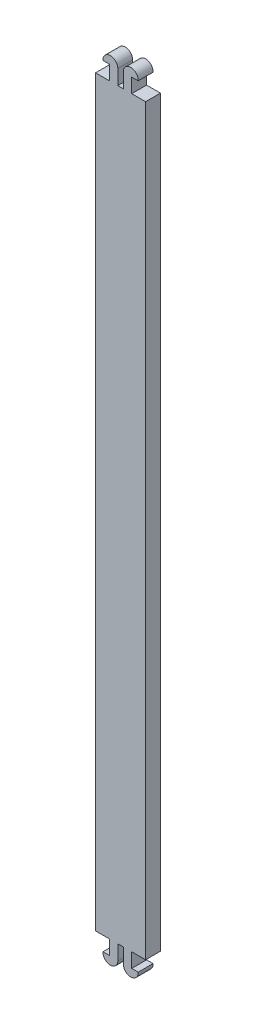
ISO-10303-21;
HEADER;
FILE_DESCRIPTION(('STEP AP214'),'2;1');
FILE_NAME('part.step','',(''),(''),'','','');
FILE_SCHEMA(('AUTOMOTIVE_DESIGN { 1 0 10303 214 1 1 1 1 }'));
ENDSEC;
DATA;
#1=APPLICATION_CONTEXT('core data for automotive mechanical design processes');
#2=APPLICATION_PROTOCOL_DEFINITION('international standard','automotive_design',2000,#1);
#3=PRODUCT_CONTEXT('',#1,'mechanical');
#4=PRODUCT('Part','Part','',(#3));
#5=PRODUCT_RELATED_PRODUCT_CATEGORY('part','',(#4));
#6=PRODUCT_DEFINITION_FORMATION('','',#4);
#7=PRODUCT_DEFINITION_CONTEXT('part definition',#1,'design');
#8=PRODUCT_DEFINITION('design','',#6,#7);
#9=PRODUCT_DEFINITION_SHAPE('','',#8);
#10=(LENGTH_UNIT() NAMED_UNIT(*) SI_UNIT(.MILLI.,.METRE.));
#11=(NAMED_UNIT(*) PLANE_ANGLE_UNIT() SI_UNIT($,.RADIAN.));
#12=(NAMED_UNIT(*) SI_UNIT($,.STERADIAN.) SOLID_ANGLE_UNIT());
#13=UNCERTAINTY_MEASURE_WITH_UNIT(LENGTH_MEASURE(1.E-05),#10,'distance_accuracy_value','');
#14=(GEOMETRIC_REPRESENTATION_CONTEXT(3) GLOBAL_UNCERTAINTY_ASSIGNED_CONTEXT((#13)) GLOBAL_UNIT_ASSIGNED_CONTEXT((#10,
#11,#12)) REPRESENTATION_CONTEXT('',''));
#15=CARTESIAN_POINT('',(0.,0.,0.));
#16=DIRECTION('',(0.,0.,1.));
#17=DIRECTION('',(1.,0.,0.));
#18=AXIS2_PLACEMENT_3D('',#15,#16,#17);
#19=CARTESIAN_POINT('',(2.058,-115.5,3.));
#20=DIRECTION('',(0.,0.,-1.));
#21=DIRECTION('',(-1.,0.,0.));
#22=AXIS2_PLACEMENT_3D('',#19,#20,#21);
#23=CYLINDRICAL_SURFACE('',#22,1.504);
#24=CARTESIAN_POINT('',(2.058,-115.5,0.));
#25=DIRECTION('',(0.,0.,1.));
#26=DIRECTION('',(1.,0.,0.));
#27=AXIS2_PLACEMENT_3D('',#24,#25,#26);
#28=CIRCLE('',#27,1.504);
#29=CARTESIAN_POINT('',(3.5586718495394,-115.4,0.));
#30=VERTEX_POINT('',#29);
#31=CARTESIAN_POINT('',(0.553999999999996,-115.5,0.));
#32=VERTEX_POINT('',#31);
#33=EDGE_CURVE('E239',#30,#32,#28,.F.);
#34=ORIENTED_EDGE('',*,*,#33,.F.);
#35=DIRECTION('',(0.,0.,-1.));
#36=VECTOR('',#35,1.);
#37=CARTESIAN_POINT('',(3.5586718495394,-115.4,3.));
#38=LINE('',#37,#36);
#39=CARTESIAN_POINT('',(3.5586718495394,-115.4,3.));
#40=VERTEX_POINT('',#39);
#41=EDGE_CURVE('E11',#40,#30,#38,.T.);
#42=ORIENTED_EDGE('',*,*,#41,.F.);
#43=CARTESIAN_POINT('',(2.058,-115.5,3.));
#44=DIRECTION('',(0.,0.,1.));
#45=DIRECTION('',(1.,0.,0.));
#46=AXIS2_PLACEMENT_3D('',#43,#44,#45);
#47=CIRCLE('',#46,1.504);
#48=CARTESIAN_POINT('',(0.553999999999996,-115.5,3.));
#49=VERTEX_POINT('',#48);
#50=EDGE_CURVE('E324',#40,#49,#47,.F.);
#51=ORIENTED_EDGE('',*,*,#50,.T.);
#52=DIRECTION('',(0.,0.,-1.));
#53=VECTOR('',#52,1.);
#54=CARTESIAN_POINT('',(0.553999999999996,-115.5,3.));
#55=LINE('',#54,#53);
#56=EDGE_CURVE('E145',#49,#32,#55,.T.);
#57=ORIENTED_EDGE('',*,*,#56,.T.);
#58=EDGE_LOOP('',(#34,#42,#51,#57));
#59=FACE_BOUND('',#58,.T.);
#60=ADVANCED_FACE('F46',(#59),#23,.T.);
#61=CARTESIAN_POINT('',(0.,-115.4,3.));
#62=DIRECTION('',(0.,1.,0.));
#63=DIRECTION('',(0.,0.,1.));
#64=AXIS2_PLACEMENT_3D('',#61,#62,#63);
#65=PLANE('',#64);
#66=DIRECTION('',(1.,0.,0.));
#67=VECTOR('',#66,1.);
#68=CARTESIAN_POINT('',(0.,-115.4,0.));
#69=LINE('',#68,#67);
#70=CARTESIAN_POINT('',(2.254,-115.4,0.));
#71=VERTEX_POINT('',#70);
#72=EDGE_CURVE('E243',#71,#30,#69,.T.);
#73=ORIENTED_EDGE('',*,*,#72,.F.);
#74=DIRECTION('',(0.,0.,-1.));
#75=VECTOR('',#74,1.);
#76=CARTESIAN_POINT('',(2.254,-115.4,3.));
#77=LINE('',#76,#75);
#78=CARTESIAN_POINT('',(2.254,-115.4,3.));
#79=VERTEX_POINT('',#78);
#80=EDGE_CURVE('E55',#79,#71,#77,.T.);
#81=ORIENTED_EDGE('',*,*,#80,.F.);
#82=DIRECTION('',(1.,0.,0.));
#83=VECTOR('',#82,1.);
#84=CARTESIAN_POINT('',(0.,-115.4,3.));
#85=LINE('',#84,#83);
#86=EDGE_CURVE('E414',#79,#40,#85,.T.);
#87=ORIENTED_EDGE('',*,*,#86,.T.);
#88=ORIENTED_EDGE('',*,*,#41,.T.);
#89=EDGE_LOOP('',(#73,#81,#87,#88));
#90=FACE_BOUND('',#89,.T.);
#91=ADVANCED_FACE('F402',(#90),#65,.T.);
#92=CARTESIAN_POINT('',(2.254,0.,3.));
#93=DIRECTION('',(1.,0.,0.));
#94=DIRECTION('',(0.,0.,-1.));
#95=AXIS2_PLACEMENT_3D('',#92,#93,#94);
#96=PLANE('',#95);
#97=DIRECTION('',(0.,-1.,0.));
#98=VECTOR('',#97,1.);
#99=CARTESIAN_POINT('',(2.254,0.,0.));
#100=LINE('',#99,#98);
#101=CARTESIAN_POINT('',(2.254,-112.5,0.));
#102=VERTEX_POINT('',#101);
#103=EDGE_CURVE('E247',#102,#71,#100,.T.);
#104=ORIENTED_EDGE('',*,*,#103,.F.);
#105=DIRECTION('',(0.,0.,-1.));
#106=VECTOR('',#105,1.);
#107=CARTESIAN_POINT('',(2.254,-112.5,3.));
#108=LINE('',#107,#106);
#109=CARTESIAN_POINT('',(2.254,-112.5,3.));
#110=VERTEX_POINT('',#109);
#111=EDGE_CURVE('E389',#110,#102,#108,.T.);
#112=ORIENTED_EDGE('',*,*,#111,.F.);
#113=DIRECTION('',(0.,-1.,0.));
#114=VECTOR('',#113,1.);
#115=CARTESIAN_POINT('',(2.254,0.,3.));
#116=LINE('',#115,#114);
#117=EDGE_CURVE('E398',#110,#79,#116,.T.);
#118=ORIENTED_EDGE('',*,*,#117,.T.);
#119=ORIENTED_EDGE('',*,*,#80,.T.);
#120=EDGE_LOOP('',(#104,#112,#118,#119));
#121=FACE_BOUND('',#120,.T.);
#122=ADVANCED_FACE('F396',(#121),#96,.T.);
#123=CARTESIAN_POINT('',(0.,-112.5,3.));
#124=DIRECTION('',(0.,-1.,0.));
#125=DIRECTION('',(0.,0.,-1.));
#126=AXIS2_PLACEMENT_3D('',#123,#124,#125);
#127=PLANE('',#126);
#128=DIRECTION('',(-1.,0.,0.));
#129=VECTOR('',#128,1.);
#130=CARTESIAN_POINT('',(0.,-112.5,0.));
#131=LINE('',#130,#129);
#132=CARTESIAN_POINT('',(5.05,-112.5,0.));
#133=VERTEX_POINT('',#132);
#134=EDGE_CURVE('E251',#133,#102,#131,.T.);
#135=ORIENTED_EDGE('',*,*,#134,.F.);
#136=DIRECTION('',(0.,0.,-1.));
#137=VECTOR('',#136,1.);
#138=CARTESIAN_POINT('',(5.05,-112.5,3.));
#139=LINE('',#138,#137);
#140=CARTESIAN_POINT('',(5.05,-112.5,3.));
#141=VERTEX_POINT('',#140);
#142=EDGE_CURVE('E386',#141,#133,#139,.T.);
#143=ORIENTED_EDGE('',*,*,#142,.F.);
#144=DIRECTION('',(-1.,0.,0.));
#145=VECTOR('',#144,1.);
#146=CARTESIAN_POINT('',(0.,-112.5,3.));
#147=LINE('',#146,#145);
#148=EDGE_CURVE('E413',#141,#110,#147,.T.);
#149=ORIENTED_EDGE('',*,*,#148,.T.);
#150=ORIENTED_EDGE('',*,*,#111,.T.);
#151=EDGE_LOOP('',(#135,#143,#149,#150));
#152=FACE_BOUND('',#151,.T.);
#153=ADVANCED_FACE('F409',(#152),#127,.T.);
#154=CARTESIAN_POINT('',(5.05,0.,3.));
#155=DIRECTION('',(-1.,0.,0.));
#156=DIRECTION('',(0.,0.,1.));
#157=AXIS2_PLACEMENT_3D('',#154,#155,#156);
#158=PLANE('',#157);
#159=DIRECTION('',(0.,1.,0.));
#160=VECTOR('',#159,1.);
#161=CARTESIAN_POINT('',(5.05,0.,0.));
#162=LINE('',#161,#160);
#163=CARTESIAN_POINT('',(5.05,37.5,0.));
#164=VERTEX_POINT('',#163);
#165=EDGE_CURVE('E255',#133,#164,#162,.T.);
#166=ORIENTED_EDGE('',*,*,#165,.T.);
#167=DIRECTION('',(0.,0.,-1.));
#168=VECTOR('',#167,1.);
#169=CARTESIAN_POINT('',(5.05,37.5,3.));
#170=LINE('',#169,#168);
#171=CARTESIAN_POINT('',(5.05,37.5,3.));
#172=VERTEX_POINT('',#171);
#173=EDGE_CURVE('E382',#172,#164,#170,.T.);
#174=ORIENTED_EDGE('',*,*,#173,.F.);
#175=DIRECTION('',(0.,1.,0.));
#176=VECTOR('',#175,1.);
#177=CARTESIAN_POINT('',(5.05,0.,3.));
#178=LINE('',#177,#176);
#179=EDGE_CURVE('E419',#141,#172,#178,.T.);
#180=ORIENTED_EDGE('',*,*,#179,.F.);
#181=ORIENTED_EDGE('',*,*,#142,.T.);
#182=EDGE_LOOP('',(#166,#174,#180,#181));
#183=FACE_BOUND('',#182,.T.);
#184=ADVANCED_FACE('F501',(#183),#158,.F.);
#185=CARTESIAN_POINT('',(0.,37.5,3.));
#186=DIRECTION('',(0.,-1.,0.));
#187=DIRECTION('',(0.,0.,-1.));
#188=AXIS2_PLACEMENT_3D('',#185,#186,#187);
#189=PLANE('',#188);
#190=DIRECTION('',(-1.,0.,0.));
#191=VECTOR('',#190,1.);
#192=CARTESIAN_POINT('',(0.,37.5,0.));
#193=LINE('',#192,#191);
#194=CARTESIAN_POINT('',(2.254,37.5,0.));
#195=VERTEX_POINT('',#194);
#196=EDGE_CURVE('E258',#164,#195,#193,.T.);
#197=ORIENTED_EDGE('',*,*,#196,.T.);
#198=DIRECTION('',(0.,0.,-1.));
#199=VECTOR('',#198,1.);
#200=CARTESIAN_POINT('',(2.254,37.5,3.));
#201=LINE('',#200,#199);
#202=CARTESIAN_POINT('',(2.254,37.5,3.));
#203=VERTEX_POINT('',#202);
#204=EDGE_CURVE('E378',#203,#195,#201,.T.);
#205=ORIENTED_EDGE('',*,*,#204,.F.);
#206=DIRECTION('',(-1.,0.,0.));
#207=VECTOR('',#206,1.);
#208=CARTESIAN_POINT('',(0.,37.5,3.));
#209=LINE('',#208,#207);
#210=EDGE_CURVE('E426',#172,#203,#209,.T.);
#211=ORIENTED_EDGE('',*,*,#210,.F.);
#212=ORIENTED_EDGE('',*,*,#173,.T.);
#213=EDGE_LOOP('',(#197,#205,#211,#212));
#214=FACE_BOUND('',#213,.T.);
#215=ADVANCED_FACE('F504',(#214),#189,.F.);
#216=CARTESIAN_POINT('',(2.254,0.,3.));
#217=DIRECTION('',(-1.,0.,0.));
#218=DIRECTION('',(0.,0.,1.));
#219=AXIS2_PLACEMENT_3D('',#216,#217,#218);
#220=PLANE('',#219);
#221=DIRECTION('',(0.,1.,0.));
#222=VECTOR('',#221,1.);
#223=CARTESIAN_POINT('',(2.254,0.,0.));
#224=LINE('',#223,#222);
#225=CARTESIAN_POINT('',(2.254,40.4,0.));
#226=VERTEX_POINT('',#225);
#227=EDGE_CURVE('E261',#195,#226,#224,.T.);
#228=ORIENTED_EDGE('',*,*,#227,.T.);
#229=DIRECTION('',(0.,0.,-1.));
#230=VECTOR('',#229,1.);
#231=CARTESIAN_POINT('',(2.254,40.4,3.));
#232=LINE('',#231,#230);
#233=CARTESIAN_POINT('',(2.254,40.4,3.));
#234=VERTEX_POINT('',#233);
#235=EDGE_CURVE('E374',#234,#226,#232,.T.);
#236=ORIENTED_EDGE('',*,*,#235,.F.);
#237=DIRECTION('',(0.,1.,0.));
#238=VECTOR('',#237,1.);
#239=CARTESIAN_POINT('',(2.254,0.,3.));
#240=LINE('',#239,#238);
#241=EDGE_CURVE('E429',#203,#234,#240,.T.);
#242=ORIENTED_EDGE('',*,*,#241,.F.);
#243=ORIENTED_EDGE('',*,*,#204,.T.);
#244=EDGE_LOOP('',(#228,#236,#242,#243));
#245=FACE_BOUND('',#244,.T.);
#246=ADVANCED_FACE('F508',(#245),#220,.F.);
#247=CARTESIAN_POINT('',(0.,40.4,3.));
#248=DIRECTION('',(0.,1.,0.));
#249=DIRECTION('',(0.,0.,1.));
#250=AXIS2_PLACEMENT_3D('',#247,#248,#249);
#251=PLANE('',#250);
#252=DIRECTION('',(1.,0.,0.));
#253=VECTOR('',#252,1.);
#254=CARTESIAN_POINT('',(0.,40.4,0.));
#255=LINE('',#254,#253);
#256=CARTESIAN_POINT('',(3.5586718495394,40.4,0.));
#257=VERTEX_POINT('',#256);
#258=EDGE_CURVE('E264',#226,#257,#255,.T.);
#259=ORIENTED_EDGE('',*,*,#258,.T.);
#260=DIRECTION('',(0.,0.,-1.));
#261=VECTOR('',#260,1.);
#262=CARTESIAN_POINT('',(3.5586718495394,40.4,3.));
#263=LINE('',#262,#261);
#264=CARTESIAN_POINT('',(3.5586718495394,40.4,3.));
#265=VERTEX_POINT('',#264);
#266=EDGE_CURVE('E370',#265,#257,#263,.T.);
#267=ORIENTED_EDGE('',*,*,#266,.F.);
#268=DIRECTION('',(1.,0.,0.));
#269=VECTOR('',#268,1.);
#270=CARTESIAN_POINT('',(0.,40.4,3.));
#271=LINE('',#270,#269);
#272=EDGE_CURVE('E432',#234,#265,#271,.T.);
#273=ORIENTED_EDGE('',*,*,#272,.F.);
#274=ORIENTED_EDGE('',*,*,#235,.T.);
#275=EDGE_LOOP('',(#259,#267,#273,#274));
#276=FACE_BOUND('',#275,.T.);
#277=ADVANCED_FACE('F512',(#276),#251,.F.);
#278=CARTESIAN_POINT('',(2.058,40.5,3.));
#279=DIRECTION('',(0.,0.,-1.));
#280=DIRECTION('',(-1.,0.,0.));
#281=AXIS2_PLACEMENT_3D('',#278,#279,#280);
#282=CYLINDRICAL_SURFACE('',#281,1.504);
#283=CARTESIAN_POINT('',(2.058,40.5,0.));
#284=DIRECTION('',(0.,0.,1.));
#285=DIRECTION('',(1.,0.,0.));
#286=AXIS2_PLACEMENT_3D('',#283,#284,#285);
#287=CIRCLE('',#286,1.504);
#288=CARTESIAN_POINT('',(0.553999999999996,40.5,0.));
#289=VERTEX_POINT('',#288);
#290=EDGE_CURVE('E267',#257,#289,#287,.T.);
#291=ORIENTED_EDGE('',*,*,#290,.T.);
#292=DIRECTION('',(0.,0.,-1.));
#293=VECTOR('',#292,1.);
#294=CARTESIAN_POINT('',(0.553999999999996,40.5,3.));
#295=LINE('',#294,#293);
#296=CARTESIAN_POINT('',(0.553999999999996,40.5,3.));
#297=VERTEX_POINT('',#296);
#298=EDGE_CURVE('E367',#297,#289,#295,.T.);
#299=ORIENTED_EDGE('',*,*,#298,.F.);
#300=CARTESIAN_POINT('',(2.058,40.5,3.));
#301=DIRECTION('',(0.,0.,1.));
#302=DIRECTION('',(1.,0.,0.));
#303=AXIS2_PLACEMENT_3D('',#300,#301,#302);
#304=CIRCLE('',#303,1.504);
#305=EDGE_CURVE('E435',#265,#297,#304,.T.);
#306=ORIENTED_EDGE('',*,*,#305,.F.);
#307=ORIENTED_EDGE('',*,*,#266,.T.);
#308=EDGE_LOOP('',(#291,#299,#306,#307));
#309=FACE_BOUND('',#308,.T.);
#310=ADVANCED_FACE('F516',(#309),#282,.T.);
#311=CARTESIAN_POINT('',(0.553999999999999,0.,3.));
#312=DIRECTION('',(-1.,0.,0.));
#313=DIRECTION('',(0.,-1.,0.));
#314=AXIS2_PLACEMENT_3D('',#311,#312,#313);
#315=PLANE('',#314);
#316=DIRECTION('',(0.,1.,0.));
#317=VECTOR('',#316,1.);
#318=CARTESIAN_POINT('',(0.553999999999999,0.,0.));
#319=LINE('',#318,#317);
#320=CARTESIAN_POINT('',(0.553999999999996,37.5,0.));
#321=VERTEX_POINT('',#320);
#322=EDGE_CURVE('E271',#321,#289,#319,.T.);
#323=ORIENTED_EDGE('',*,*,#322,.F.);
#324=DIRECTION('',(0.,0.,-1.));
#325=VECTOR('',#324,1.);
#326=CARTESIAN_POINT('',(0.553999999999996,37.5,3.));
#327=LINE('',#326,#325);
#328=CARTESIAN_POINT('',(0.553999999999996,37.5,3.));
#329=VERTEX_POINT('',#328);
#330=EDGE_CURVE('E364',#329,#321,#327,.T.);
#331=ORIENTED_EDGE('',*,*,#330,.F.);
#332=DIRECTION('',(0.,1.,0.));
#333=VECTOR('',#332,1.);
#334=CARTESIAN_POINT('',(0.553999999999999,0.,3.));
#335=LINE('',#334,#333);
#336=EDGE_CURVE('E438',#329,#297,#335,.T.);
#337=ORIENTED_EDGE('',*,*,#336,.T.);
#338=ORIENTED_EDGE('',*,*,#298,.T.);
#339=EDGE_LOOP('',(#323,#331,#337,#338));
#340=FACE_BOUND('',#339,.T.);
#341=ADVANCED_FACE('F520',(#340),#315,.T.);
#342=CARTESIAN_POINT('',(0.,37.5,3.));
#343=DIRECTION('',(0.,-1.,0.));
#344=DIRECTION('',(0.,0.,-1.));
#345=AXIS2_PLACEMENT_3D('',#342,#343,#344);
#346=PLANE('',#345);
#347=DIRECTION('',(-1.,0.,0.));
#348=VECTOR('',#347,1.);
#349=CARTESIAN_POINT('',(0.,37.5,0.));
#350=LINE('',#349,#348);
#351=CARTESIAN_POINT('',(-0.554000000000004,37.5,0.));
#352=VERTEX_POINT('',#351);
#353=EDGE_CURVE('E275',#321,#352,#350,.T.);
#354=ORIENTED_EDGE('',*,*,#353,.T.);
#355=DIRECTION('',(0.,0.,-1.));
#356=VECTOR('',#355,1.);
#357=CARTESIAN_POINT('',(-0.554000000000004,37.5,3.));
#358=LINE('',#357,#356);
#359=CARTESIAN_POINT('',(-0.554000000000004,37.5,3.));
#360=VERTEX_POINT('',#359);
#361=EDGE_CURVE('E360',#360,#352,#358,.T.);
#362=ORIENTED_EDGE('',*,*,#361,.F.);
#363=DIRECTION('',(-1.,0.,0.));
#364=VECTOR('',#363,1.);
#365=CARTESIAN_POINT('',(0.,37.5,3.));
#366=LINE('',#365,#364);
#367=EDGE_CURVE('E442',#329,#360,#366,.T.);
#368=ORIENTED_EDGE('',*,*,#367,.F.);
#369=ORIENTED_EDGE('',*,*,#330,.T.);
#370=EDGE_LOOP('',(#354,#362,#368,#369));
#371=FACE_BOUND('',#370,.T.);
#372=ADVANCED_FACE('F524',(#371),#346,.F.);
#373=CARTESIAN_POINT('',(-0.554000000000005,0.,3.));
#374=DIRECTION('',(-1.,0.,0.));
#375=DIRECTION('',(0.,-1.,0.));
#376=AXIS2_PLACEMENT_3D('',#373,#374,#375);
#377=PLANE('',#376);
#378=DIRECTION('',(0.,1.,0.));
#379=VECTOR('',#378,1.);
#380=CARTESIAN_POINT('',(-0.554000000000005,0.,0.));
#381=LINE('',#380,#379);
#382=CARTESIAN_POINT('',(-0.554000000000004,40.5,0.));
#383=VERTEX_POINT('',#382);
#384=EDGE_CURVE('E278',#352,#383,#381,.T.);
#385=ORIENTED_EDGE('',*,*,#384,.T.);
#386=DIRECTION('',(0.,0.,-1.));
#387=VECTOR('',#386,1.);
#388=CARTESIAN_POINT('',(-0.554000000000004,40.5,3.));
#389=LINE('',#388,#387);
#390=CARTESIAN_POINT('',(-0.554000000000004,40.5,3.));
#391=VERTEX_POINT('',#390);
#392=EDGE_CURVE('E357',#391,#383,#389,.T.);
#393=ORIENTED_EDGE('',*,*,#392,.F.);
#394=DIRECTION('',(0.,1.,0.));
#395=VECTOR('',#394,1.);
#396=CARTESIAN_POINT('',(-0.554000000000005,0.,3.));
#397=LINE('',#396,#395);
#398=EDGE_CURVE('E445',#360,#391,#397,.T.);
#399=ORIENTED_EDGE('',*,*,#398,.F.);
#400=ORIENTED_EDGE('',*,*,#361,.T.);
#401=EDGE_LOOP('',(#385,#393,#399,#400));
#402=FACE_BOUND('',#401,.T.);
#403=ADVANCED_FACE('F528',(#402),#377,.F.);
#404=CARTESIAN_POINT('',(-2.058,40.5,3.));
#405=DIRECTION('',(0.,0.,-1.));
#406=DIRECTION('',(-1.,0.,0.));
#407=AXIS2_PLACEMENT_3D('',#404,#405,#406);
#408=CYLINDRICAL_SURFACE('',#407,1.504);
#409=CARTESIAN_POINT('',(-2.058,40.5,0.));
#410=DIRECTION('',(0.,0.,1.));
#411=DIRECTION('',(1.,0.,0.));
#412=AXIS2_PLACEMENT_3D('',#409,#410,#411);
#413=CIRCLE('',#412,1.504);
#414=CARTESIAN_POINT('',(-3.5586718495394,40.4,0.));
#415=VERTEX_POINT('',#414);
#416=EDGE_CURVE('E282',#415,#383,#413,.F.);
#417=ORIENTED_EDGE('',*,*,#416,.F.);
#418=DIRECTION('',(0.,0.,-1.));
#419=VECTOR('',#418,1.);
#420=CARTESIAN_POINT('',(-3.5586718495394,40.4,3.));
#421=LINE('',#420,#419);
#422=CARTESIAN_POINT('',(-3.5586718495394,40.4,3.));
#423=VERTEX_POINT('',#422);
#424=EDGE_CURVE('E354',#423,#415,#421,.T.);
#425=ORIENTED_EDGE('',*,*,#424,.F.);
#426=CARTESIAN_POINT('',(-2.058,40.5,3.));
#427=DIRECTION('',(0.,0.,1.));
#428=DIRECTION('',(1.,0.,0.));
#429=AXIS2_PLACEMENT_3D('',#426,#427,#428);
#430=CIRCLE('',#429,1.504);
#431=EDGE_CURVE('E448',#423,#391,#430,.F.);
#432=ORIENTED_EDGE('',*,*,#431,.T.);
#433=ORIENTED_EDGE('',*,*,#392,.T.);
#434=EDGE_LOOP('',(#417,#425,#432,#433));
#435=FACE_BOUND('',#434,.T.);
#436=ADVANCED_FACE('F532',(#435),#408,.T.);
#437=CARTESIAN_POINT('',(0.,40.4,3.));
#438=DIRECTION('',(0.,-1.,0.));
#439=DIRECTION('',(0.,0.,-1.));
#440=AXIS2_PLACEMENT_3D('',#437,#438,#439);
#441=PLANE('',#440);
#442=DIRECTION('',(-1.,0.,0.));
#443=VECTOR('',#442,1.);
#444=CARTESIAN_POINT('',(0.,40.4,0.));
#445=LINE('',#444,#443);
#446=CARTESIAN_POINT('',(-2.254,40.4,0.));
#447=VERTEX_POINT('',#446);
#448=EDGE_CURVE('E286',#447,#415,#445,.T.);
#449=ORIENTED_EDGE('',*,*,#448,.F.);
#450=DIRECTION('',(0.,0.,-1.));
#451=VECTOR('',#450,1.);
#452=CARTESIAN_POINT('',(-2.254,40.4,3.));
#453=LINE('',#452,#451);
#454=CARTESIAN_POINT('',(-2.254,40.4,3.));
#455=VERTEX_POINT('',#454);
#456=EDGE_CURVE('E351',#455,#447,#453,.T.);
#457=ORIENTED_EDGE('',*,*,#456,.F.);
#458=DIRECTION('',(-1.,0.,0.));
#459=VECTOR('',#458,1.);
#460=CARTESIAN_POINT('',(0.,40.4,3.));
#461=LINE('',#460,#459);
#462=EDGE_CURVE('E452',#455,#423,#461,.T.);
#463=ORIENTED_EDGE('',*,*,#462,.T.);
#464=ORIENTED_EDGE('',*,*,#424,.T.);
#465=EDGE_LOOP('',(#449,#457,#463,#464));
#466=FACE_BOUND('',#465,.T.);
#467=ADVANCED_FACE('F536',(#466),#441,.T.);
#468=CARTESIAN_POINT('',(-2.254,0.,3.));
#469=DIRECTION('',(-1.,0.,0.));
#470=DIRECTION('',(0.,0.,1.));
#471=AXIS2_PLACEMENT_3D('',#468,#469,#470);
#472=PLANE('',#471);
#473=DIRECTION('',(0.,1.,0.));
#474=VECTOR('',#473,1.);
#475=CARTESIAN_POINT('',(-2.254,0.,0.));
#476=LINE('',#475,#474);
#477=CARTESIAN_POINT('',(-2.254,37.5,0.));
#478=VERTEX_POINT('',#477);
#479=EDGE_CURVE('E290',#478,#447,#476,.T.);
#480=ORIENTED_EDGE('',*,*,#479,.F.);
#481=DIRECTION('',(0.,0.,-1.));
#482=VECTOR('',#481,1.);
#483=CARTESIAN_POINT('',(-2.254,37.5,3.));
#484=LINE('',#483,#482);
#485=CARTESIAN_POINT('',(-2.254,37.5,3.));
#486=VERTEX_POINT('',#485);
#487=EDGE_CURVE('E348',#486,#478,#484,.T.);
#488=ORIENTED_EDGE('',*,*,#487,.F.);
#489=DIRECTION('',(0.,1.,0.));
#490=VECTOR('',#489,1.);
#491=CARTESIAN_POINT('',(-2.254,0.,3.));
#492=LINE('',#491,#490);
#493=EDGE_CURVE('E456',#486,#455,#492,.T.);
#494=ORIENTED_EDGE('',*,*,#493,.T.);
#495=ORIENTED_EDGE('',*,*,#456,.T.);
#496=EDGE_LOOP('',(#480,#488,#494,#495));
#497=FACE_BOUND('',#496,.T.);
#498=ADVANCED_FACE('F540',(#497),#472,.T.);
#499=CARTESIAN_POINT('',(0.,37.5,3.));
#500=DIRECTION('',(0.,-1.,0.));
#501=DIRECTION('',(0.,0.,-1.));
#502=AXIS2_PLACEMENT_3D('',#499,#500,#501);
#503=PLANE('',#502);
#504=DIRECTION('',(-1.,0.,0.));
#505=VECTOR('',#504,1.);
#506=CARTESIAN_POINT('',(0.,37.5,0.));
#507=LINE('',#506,#505);
#508=CARTESIAN_POINT('',(-5.05,37.5,0.));
#509=VERTEX_POINT('',#508);
#510=EDGE_CURVE('E294',#478,#509,#507,.T.);
#511=ORIENTED_EDGE('',*,*,#510,.T.);
#512=DIRECTION('',(0.,0.,-1.));
#513=VECTOR('',#512,1.);
#514=CARTESIAN_POINT('',(-5.05,37.5,3.));
#515=LINE('',#514,#513);
#516=CARTESIAN_POINT('',(-5.05,37.5,3.));
#517=VERTEX_POINT('',#516);
#518=EDGE_CURVE('E345',#517,#509,#515,.T.);
#519=ORIENTED_EDGE('',*,*,#518,.F.);
#520=DIRECTION('',(-1.,0.,0.));
#521=VECTOR('',#520,1.);
#522=CARTESIAN_POINT('',(0.,37.5,3.));
#523=LINE('',#522,#521);
#524=EDGE_CURVE('E460',#486,#517,#523,.T.);
#525=ORIENTED_EDGE('',*,*,#524,.F.);
#526=ORIENTED_EDGE('',*,*,#487,.T.);
#527=EDGE_LOOP('',(#511,#519,#525,#526));
#528=FACE_BOUND('',#527,.T.);
#529=ADVANCED_FACE('F544',(#528),#503,.F.);
#530=CARTESIAN_POINT('',(-5.05,0.,3.));
#531=DIRECTION('',(-1.,0.,0.));
#532=DIRECTION('',(0.,0.,1.));
#533=AXIS2_PLACEMENT_3D('',#530,#531,#532);
#534=PLANE('',#533);
#535=DIRECTION('',(0.,1.,0.));
#536=VECTOR('',#535,1.);
#537=CARTESIAN_POINT('',(-5.05,0.,0.));
#538=LINE('',#537,#536);
#539=CARTESIAN_POINT('',(-5.05,-112.5,0.));
#540=VERTEX_POINT('',#539);
#541=EDGE_CURVE('E298',#540,#509,#538,.T.);
#542=ORIENTED_EDGE('',*,*,#541,.F.);
#543=DIRECTION('',(0.,0.,-1.));
#544=VECTOR('',#543,1.);
#545=CARTESIAN_POINT('',(-5.05,-112.5,3.));
#546=LINE('',#545,#544);
#547=CARTESIAN_POINT('',(-5.05,-112.5,3.));
#548=VERTEX_POINT('',#547);
#549=EDGE_CURVE('E342',#548,#540,#546,.T.);
#550=ORIENTED_EDGE('',*,*,#549,.F.);
#551=DIRECTION('',(0.,1.,0.));
#552=VECTOR('',#551,1.);
#553=CARTESIAN_POINT('',(-5.05,0.,3.));
#554=LINE('',#553,#552);
#555=EDGE_CURVE('E463',#548,#517,#554,.T.);
#556=ORIENTED_EDGE('',*,*,#555,.T.);
#557=ORIENTED_EDGE('',*,*,#518,.T.);
#558=EDGE_LOOP('',(#542,#550,#556,#557));
#559=FACE_BOUND('',#558,.T.);
#560=ADVANCED_FACE('F548',(#559),#534,.T.);
#561=CARTESIAN_POINT('',(-5.58387384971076E-13,-112.5,3.));
#562=DIRECTION('',(0.,-1.,0.));
#563=DIRECTION('',(1.,0.,0.));
#564=AXIS2_PLACEMENT_3D('',#561,#562,#563);
#565=PLANE('',#564);
#566=DIRECTION('',(-1.,0.,0.));
#567=VECTOR('',#566,1.);
#568=CARTESIAN_POINT('',(-5.58387384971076E-13,-112.5,0.));
#569=LINE('',#568,#567);
#570=CARTESIAN_POINT('',(-2.254,-112.5,0.));
#571=VERTEX_POINT('',#570);
#572=EDGE_CURVE('E302',#571,#540,#569,.T.);
#573=ORIENTED_EDGE('',*,*,#572,.F.);
#574=DIRECTION('',(0.,0.,-1.));
#575=VECTOR('',#574,1.);
#576=CARTESIAN_POINT('',(-2.254,-112.5,3.));
#577=LINE('',#576,#575);
#578=CARTESIAN_POINT('',(-2.254,-112.5,3.));
#579=VERTEX_POINT('',#578);
#580=EDGE_CURVE('E339',#579,#571,#577,.T.);
#581=ORIENTED_EDGE('',*,*,#580,.F.);
#582=DIRECTION('',(-1.,0.,0.));
#583=VECTOR('',#582,1.);
#584=CARTESIAN_POINT('',(-5.58387384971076E-13,-112.5,3.));
#585=LINE('',#584,#583);
#586=EDGE_CURVE('E467',#579,#548,#585,.T.);
#587=ORIENTED_EDGE('',*,*,#586,.T.);
#588=ORIENTED_EDGE('',*,*,#549,.T.);
#589=EDGE_LOOP('',(#573,#581,#587,#588));
#590=FACE_BOUND('',#589,.T.);
#591=ADVANCED_FACE('F552',(#590),#565,.T.);
#592=CARTESIAN_POINT('',(-2.254,0.,3.));
#593=DIRECTION('',(1.,0.,0.));
#594=DIRECTION('',(0.,0.,-1.));
#595=AXIS2_PLACEMENT_3D('',#592,#593,#594);
#596=PLANE('',#595);
#597=DIRECTION('',(0.,-1.,0.));
#598=VECTOR('',#597,1.);
#599=CARTESIAN_POINT('',(-2.254,0.,0.));
#600=LINE('',#599,#598);
#601=CARTESIAN_POINT('',(-2.254,-115.4,0.));
#602=VERTEX_POINT('',#601);
#603=EDGE_CURVE('E306',#571,#602,#600,.T.);
#604=ORIENTED_EDGE('',*,*,#603,.T.);
#605=DIRECTION('',(0.,0.,-1.));
#606=VECTOR('',#605,1.);
#607=CARTESIAN_POINT('',(-2.254,-115.4,3.));
#608=LINE('',#607,#606);
#609=CARTESIAN_POINT('',(-2.254,-115.4,3.));
#610=VERTEX_POINT('',#609);
#611=EDGE_CURVE('E335',#610,#602,#608,.T.);
#612=ORIENTED_EDGE('',*,*,#611,.F.);
#613=DIRECTION('',(0.,-1.,0.));
#614=VECTOR('',#613,1.);
#615=CARTESIAN_POINT('',(-2.254,0.,3.));
#616=LINE('',#615,#614);
#617=EDGE_CURVE('E471',#579,#610,#616,.T.);
#618=ORIENTED_EDGE('',*,*,#617,.F.);
#619=ORIENTED_EDGE('',*,*,#580,.T.);
#620=EDGE_LOOP('',(#604,#612,#618,#619));
#621=FACE_BOUND('',#620,.T.);
#622=ADVANCED_FACE('F556',(#621),#596,.F.);
#623=CARTESIAN_POINT('',(0.,-115.4,3.));
#624=DIRECTION('',(0.,-1.,0.));
#625=DIRECTION('',(0.,0.,-1.));
#626=AXIS2_PLACEMENT_3D('',#623,#624,#625);
#627=PLANE('',#626);
#628=DIRECTION('',(-1.,0.,0.));
#629=VECTOR('',#628,1.);
#630=CARTESIAN_POINT('',(0.,-115.4,0.));
#631=LINE('',#630,#629);
#632=CARTESIAN_POINT('',(-3.5586718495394,-115.4,0.));
#633=VERTEX_POINT('',#632);
#634=EDGE_CURVE('E309',#602,#633,#631,.T.);
#635=ORIENTED_EDGE('',*,*,#634,.T.);
#636=DIRECTION('',(0.,0.,-1.));
#637=VECTOR('',#636,1.);
#638=CARTESIAN_POINT('',(-3.5586718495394,-115.4,3.));
#639=LINE('',#638,#637);
#640=CARTESIAN_POINT('',(-3.5586718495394,-115.4,3.));
#641=VERTEX_POINT('',#640);
#642=EDGE_CURVE('E331',#641,#633,#639,.T.);
#643=ORIENTED_EDGE('',*,*,#642,.F.);
#644=DIRECTION('',(-1.,0.,0.));
#645=VECTOR('',#644,1.);
#646=CARTESIAN_POINT('',(0.,-115.4,3.));
#647=LINE('',#646,#645);
#648=EDGE_CURVE('E474',#610,#641,#647,.T.);
#649=ORIENTED_EDGE('',*,*,#648,.F.);
#650=ORIENTED_EDGE('',*,*,#611,.T.);
#651=EDGE_LOOP('',(#635,#643,#649,#650));
#652=FACE_BOUND('',#651,.T.);
#653=ADVANCED_FACE('F483',(#652),#627,.F.);
#654=CARTESIAN_POINT('',(-2.058,-115.5,3.));
#655=DIRECTION('',(0.,0.,-1.));
#656=DIRECTION('',(-1.,0.,0.));
#657=AXIS2_PLACEMENT_3D('',#654,#655,#656);
#658=CYLINDRICAL_SURFACE('',#657,1.504);
#659=CARTESIAN_POINT('',(-2.058,-115.5,0.));
#660=DIRECTION('',(0.,0.,1.));
#661=DIRECTION('',(1.,0.,0.));
#662=AXIS2_PLACEMENT_3D('',#659,#660,#661);
#663=CIRCLE('',#662,1.504);
#664=CARTESIAN_POINT('',(-0.554000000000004,-115.5,0.));
#665=VERTEX_POINT('',#664);
#666=EDGE_CURVE('E312',#633,#665,#663,.T.);
#667=ORIENTED_EDGE('',*,*,#666,.T.);
#668=DIRECTION('',(0.,0.,-1.));
#669=VECTOR('',#668,1.);
#670=CARTESIAN_POINT('',(-0.554000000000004,-115.5,3.));
#671=LINE('',#670,#669);
#672=CARTESIAN_POINT('',(-0.554000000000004,-115.5,3.));
#673=VERTEX_POINT('',#672);
#674=EDGE_CURVE('E223',#673,#665,#671,.T.);
#675=ORIENTED_EDGE('',*,*,#674,.F.);
#676=CARTESIAN_POINT('',(-2.058,-115.5,3.));
#677=DIRECTION('',(0.,0.,1.));
#678=DIRECTION('',(1.,0.,0.));
#679=AXIS2_PLACEMENT_3D('',#676,#677,#678);
#680=CIRCLE('',#679,1.504);
#681=EDGE_CURVE('E228',#641,#673,#680,.T.);
#682=ORIENTED_EDGE('',*,*,#681,.F.);
#683=ORIENTED_EDGE('',*,*,#642,.T.);
#684=EDGE_LOOP('',(#667,#675,#682,#683));
#685=FACE_BOUND('',#684,.T.);
#686=ADVANCED_FACE('F487',(#685),#658,.T.);
#687=CARTESIAN_POINT('',(-0.554000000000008,0.,3.));
#688=DIRECTION('',(1.,0.,0.));
#689=DIRECTION('',(0.,1.,0.));
#690=AXIS2_PLACEMENT_3D('',#687,#688,#689);
#691=PLANE('',#690);
#692=DIRECTION('',(0.,-1.,0.));
#693=VECTOR('',#692,1.);
#694=CARTESIAN_POINT('',(-0.554000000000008,0.,0.));
#695=LINE('',#694,#693);
#696=CARTESIAN_POINT('',(-0.554000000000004,-112.5,0.));
#697=VERTEX_POINT('',#696);
#698=EDGE_CURVE('E217',#697,#665,#695,.T.);
#699=ORIENTED_EDGE('',*,*,#698,.F.);
#700=DIRECTION('',(0.,0.,-1.));
#701=VECTOR('',#700,1.);
#702=CARTESIAN_POINT('',(-0.554000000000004,-112.5,3.));
#703=LINE('',#702,#701);
#704=CARTESIAN_POINT('',(-0.554000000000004,-112.5,3.));
#705=VERTEX_POINT('',#704);
#706=EDGE_CURVE('E212',#705,#697,#703,.T.);
#707=ORIENTED_EDGE('',*,*,#706,.F.);
#708=DIRECTION('',(0.,-1.,0.));
#709=VECTOR('',#708,1.);
#710=CARTESIAN_POINT('',(-0.554000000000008,0.,3.));
#711=LINE('',#710,#709);
#712=EDGE_CURVE('E215',#705,#673,#711,.T.);
#713=ORIENTED_EDGE('',*,*,#712,.T.);
#714=ORIENTED_EDGE('',*,*,#674,.T.);
#715=EDGE_LOOP('',(#699,#707,#713,#714));
#716=FACE_BOUND('',#715,.T.);
#717=ADVANCED_FACE('F214',(#716),#691,.T.);
#718=CARTESIAN_POINT('',(0.,-112.5,3.));
#719=DIRECTION('',(0.,-1.,0.));
#720=DIRECTION('',(0.,0.,-1.));
#721=AXIS2_PLACEMENT_3D('',#718,#719,#720);
#722=PLANE('',#721);
#723=DIRECTION('',(-1.,0.,0.));
#724=VECTOR('',#723,1.);
#725=CARTESIAN_POINT('',(0.,-112.5,0.));
#726=LINE('',#725,#724);
#727=CARTESIAN_POINT('',(0.553999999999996,-112.5,0.));
#728=VERTEX_POINT('',#727);
#729=EDGE_CURVE('E318',#728,#697,#726,.T.);
#730=ORIENTED_EDGE('',*,*,#729,.F.);
#731=DIRECTION('',(0.,0.,-1.));
#732=VECTOR('',#731,1.);
#733=CARTESIAN_POINT('',(0.553999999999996,-112.5,3.));
#734=LINE('',#733,#732);
#735=CARTESIAN_POINT('',(0.553999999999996,-112.5,3.));
#736=VERTEX_POINT('',#735);
#737=EDGE_CURVE('E138',#736,#728,#734,.T.);
#738=ORIENTED_EDGE('',*,*,#737,.F.);
#739=DIRECTION('',(-1.,0.,0.));
#740=VECTOR('',#739,1.);
#741=CARTESIAN_POINT('',(0.,-112.5,3.));
#742=LINE('',#741,#740);
#743=EDGE_CURVE('E226',#736,#705,#742,.T.);
#744=ORIENTED_EDGE('',*,*,#743,.T.);
#745=ORIENTED_EDGE('',*,*,#706,.T.);
#746=EDGE_LOOP('',(#730,#738,#744,#745));
#747=FACE_BOUND('',#746,.T.);
#748=ADVANCED_FACE('F232',(#747),#722,.T.);
#749=CARTESIAN_POINT('',(0.554000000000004,0.,3.));
#750=DIRECTION('',(1.,0.,0.));
#751=DIRECTION('',(0.,1.,0.));
#752=AXIS2_PLACEMENT_3D('',#749,#750,#751);
#753=PLANE('',#752);
#754=DIRECTION('',(0.,-1.,0.));
#755=VECTOR('',#754,1.);
#756=CARTESIAN_POINT('',(0.554000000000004,0.,0.));
#757=LINE('',#756,#755);
#758=EDGE_CURVE('E321',#728,#32,#757,.T.);
#759=ORIENTED_EDGE('',*,*,#758,.T.);
#760=ORIENTED_EDGE('',*,*,#56,.F.);
#761=DIRECTION('',(0.,-1.,0.));
#762=VECTOR('',#761,1.);
#763=CARTESIAN_POINT('',(0.554000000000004,0.,3.));
#764=LINE('',#763,#762);
#765=EDGE_CURVE('E63',#736,#49,#764,.T.);
#766=ORIENTED_EDGE('',*,*,#765,.F.);
#767=ORIENTED_EDGE('',*,*,#737,.T.);
#768=EDGE_LOOP('',(#759,#760,#766,#767));
#769=FACE_BOUND('',#768,.T.);
#770=ADVANCED_FACE('F488',(#769),#753,.F.);
#771=CARTESIAN_POINT('',(0.,0.,3.));
#772=DIRECTION('',(0.,0.,1.));
#773=DIRECTION('',(1.,0.,0.));
#774=AXIS2_PLACEMENT_3D('',#771,#772,#773);
#775=PLANE('',#774);
#776=ORIENTED_EDGE('',*,*,#50,.F.);
#777=ORIENTED_EDGE('',*,*,#86,.F.);
#778=ORIENTED_EDGE('',*,*,#117,.F.);
#779=ORIENTED_EDGE('',*,*,#148,.F.);
#780=ORIENTED_EDGE('',*,*,#179,.T.);
#781=ORIENTED_EDGE('',*,*,#210,.T.);
#782=ORIENTED_EDGE('',*,*,#241,.T.);
#783=ORIENTED_EDGE('',*,*,#272,.T.);
#784=ORIENTED_EDGE('',*,*,#305,.T.);
#785=ORIENTED_EDGE('',*,*,#336,.F.);
#786=ORIENTED_EDGE('',*,*,#367,.T.);
#787=ORIENTED_EDGE('',*,*,#398,.T.);
#788=ORIENTED_EDGE('',*,*,#431,.F.);
#789=ORIENTED_EDGE('',*,*,#462,.F.);
#790=ORIENTED_EDGE('',*,*,#493,.F.);
#791=ORIENTED_EDGE('',*,*,#524,.T.);
#792=ORIENTED_EDGE('',*,*,#555,.F.);
#793=ORIENTED_EDGE('',*,*,#586,.F.);
#794=ORIENTED_EDGE('',*,*,#617,.T.);
#795=ORIENTED_EDGE('',*,*,#648,.T.);
#796=ORIENTED_EDGE('',*,*,#681,.T.);
#797=ORIENTED_EDGE('',*,*,#712,.F.);
#798=ORIENTED_EDGE('',*,*,#743,.F.);
#799=ORIENTED_EDGE('',*,*,#765,.T.);
#800=EDGE_LOOP('',(#776,#777,#778,#779,#780,#781,#782,#783,#784,#785,#786,#787,#788,#789,#790,
#791,#792,#793,#794,#795,#796,#797,#798,#799));
#801=FACE_BOUND('',#800,.T.);
#802=ADVANCED_FACE('F225',(#801),#775,.T.);
#803=CARTESIAN_POINT('',(0.,0.,0.));
#804=DIRECTION('',(0.,0.,1.));
#805=DIRECTION('',(1.,0.,0.));
#806=AXIS2_PLACEMENT_3D('',#803,#804,#805);
#807=PLANE('',#806);
#808=ORIENTED_EDGE('',*,*,#33,.T.);
#809=ORIENTED_EDGE('',*,*,#758,.F.);
#810=ORIENTED_EDGE('',*,*,#729,.T.);
#811=ORIENTED_EDGE('',*,*,#698,.T.);
#812=ORIENTED_EDGE('',*,*,#666,.F.);
#813=ORIENTED_EDGE('',*,*,#634,.F.);
#814=ORIENTED_EDGE('',*,*,#603,.F.);
#815=ORIENTED_EDGE('',*,*,#572,.T.);
#816=ORIENTED_EDGE('',*,*,#541,.T.);
#817=ORIENTED_EDGE('',*,*,#510,.F.);
#818=ORIENTED_EDGE('',*,*,#479,.T.);
#819=ORIENTED_EDGE('',*,*,#448,.T.);
#820=ORIENTED_EDGE('',*,*,#416,.T.);
#821=ORIENTED_EDGE('',*,*,#384,.F.);
#822=ORIENTED_EDGE('',*,*,#353,.F.);
#823=ORIENTED_EDGE('',*,*,#322,.T.);
#824=ORIENTED_EDGE('',*,*,#290,.F.);
#825=ORIENTED_EDGE('',*,*,#258,.F.);
#826=ORIENTED_EDGE('',*,*,#227,.F.);
#827=ORIENTED_EDGE('',*,*,#196,.F.);
#828=ORIENTED_EDGE('',*,*,#165,.F.);
#829=ORIENTED_EDGE('',*,*,#134,.T.);
#830=ORIENTED_EDGE('',*,*,#103,.T.);
#831=ORIENTED_EDGE('',*,*,#72,.T.);
#832=EDGE_LOOP('',(#808,#809,#810,#811,#812,#813,#814,#815,#816,#817,#818,#819,#820,#821,#822,
#823,#824,#825,#826,#827,#828,#829,#830,#831));
#833=FACE_BOUND('',#832,.T.);
#834=ADVANCED_FACE('F404',(#833),#807,.F.);
#835=CLOSED_SHELL('',(#60,#91,#122,#153,#184,#215,#246,#277,#310,#341,#372,#403,#436,#467,#498,
#529,#560,#591,#622,#653,#686,#717,#748,#770,#802,#834));
#836=MANIFOLD_SOLID_BREP('B2',#835);
#837=ADVANCED_BREP_SHAPE_REPRESENTATION('',(#18,#836),#14);
#838=SHAPE_DEFINITION_REPRESENTATION(#9,#837);
ENDSEC;
END-ISO-10303-21;
